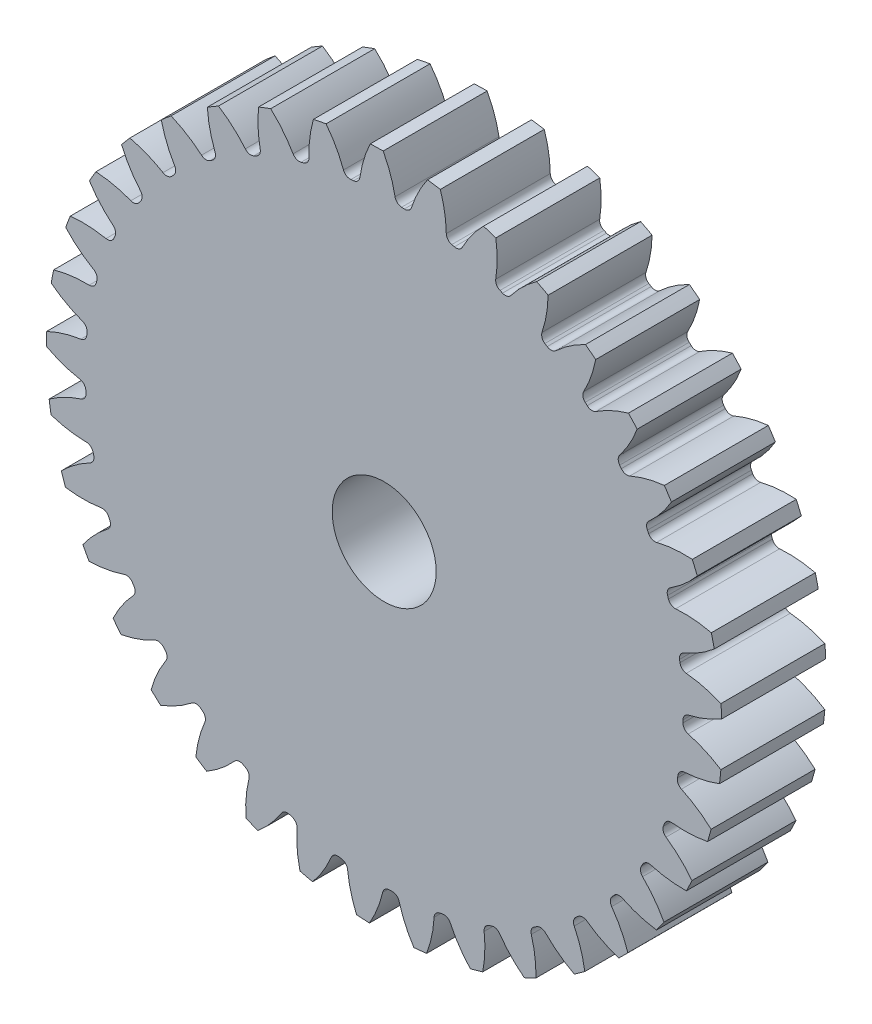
from build123d import *

# Parameters (mm, degrees)
SKETCH3_R         = 330.2
GEARBODY_DEPTH    = 101.6
TOOTHCUT_DEPTH    = 478.898148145
CIRPATTERN1_COUNT = 37
BOREDIA_R         = 50.8
BORE_DEPTH        = 12700


with BuildPart() as part:
    # Sketch3 → gearBody (new body)
    with BuildSketch(Plane.XY):
        Circle(SKETCH3_R)
    extrude(amount=GEARBODY_DEPTH)

    # Sketch2 → toothCut (cut, through all)
    with BuildSketch(Plane.XY):
        with BuildLine():
            ThreePointArc((292.009000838, -7.290639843), (292.039585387, -5.94058641), (292.063928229, -4.590406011))
            ThreePointArc((292.063928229, -4.590406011), (293.597017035, -0.363918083), (297.410268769, 2.017819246))
            ThreePointArc((297.410268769, 2.017819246), (314.321407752, 7.326932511), (330.2, 15.203709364))
            ThreePointArc((330.2, 15.203709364), (330.481466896, -6.72256026), (329.308565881, -28.619245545))
            ThreePointArc((329.308565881, -28.619245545), (313.763430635, -20.10325614), (297.082184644, -14.110816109))
            ThreePointArc((297.082184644, -14.110816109), (293.368944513, -11.575977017), (292.009000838, -7.290639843))
        make_face()
    toothcut = extrude(amount=TOOTHCUT_DEPTH, mode=Mode.SUBTRACT)

    # CirPattern1: toothCut ×37 about axis
    cirpattern1_axis = Axis((0, 0, 0), (0, 0, 1))
    for i in range(1, CIRPATTERN1_COUNT):
        add(toothcut.rotate(cirpattern1_axis, i * 360 / CIRPATTERN1_COUNT), mode=Mode.SUBTRACT)

    # boreDia → bore (cut, symmetric)
    with BuildSketch(Plane.XY):
        Circle(BOREDIA_R)
    extrude(amount=BORE_DEPTH, both=True, mode=Mode.SUBTRACT)


solid = part.part
